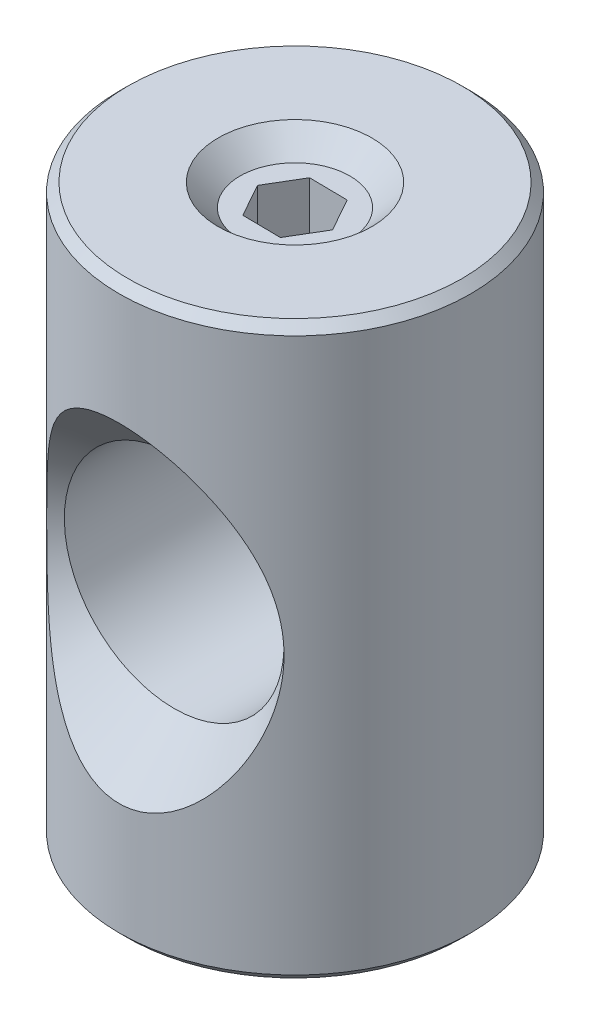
ISO-10303-21;
HEADER;
FILE_DESCRIPTION(('STEP AP214'),'2;1');
FILE_NAME('part.step','',(''),(''),'','','');
FILE_SCHEMA(('AUTOMOTIVE_DESIGN { 1 0 10303 214 1 1 1 1 }'));
ENDSEC;
DATA;
#1=APPLICATION_CONTEXT('core data for automotive mechanical design processes');
#2=APPLICATION_PROTOCOL_DEFINITION('international standard','automotive_design',2000,#1);
#3=PRODUCT_CONTEXT('',#1,'mechanical');
#4=PRODUCT('Part','Part','',(#3));
#5=PRODUCT_RELATED_PRODUCT_CATEGORY('part','',(#4));
#6=PRODUCT_DEFINITION_FORMATION('','',#4);
#7=PRODUCT_DEFINITION_CONTEXT('part definition',#1,'design');
#8=PRODUCT_DEFINITION('design','',#6,#7);
#9=PRODUCT_DEFINITION_SHAPE('','',#8);
#10=(LENGTH_UNIT() NAMED_UNIT(*) SI_UNIT(.MILLI.,.METRE.));
#11=(NAMED_UNIT(*) PLANE_ANGLE_UNIT() SI_UNIT($,.RADIAN.));
#12=(NAMED_UNIT(*) SI_UNIT($,.STERADIAN.) SOLID_ANGLE_UNIT());
#13=UNCERTAINTY_MEASURE_WITH_UNIT(LENGTH_MEASURE(1.E-05),#10,'distance_accuracy_value','');
#14=(GEOMETRIC_REPRESENTATION_CONTEXT(3) GLOBAL_UNCERTAINTY_ASSIGNED_CONTEXT((#13)) GLOBAL_UNIT_ASSIGNED_CONTEXT((#10,
#11,#12)) REPRESENTATION_CONTEXT('',''));
#15=CARTESIAN_POINT('',(0.,0.,0.));
#16=DIRECTION('',(0.,0.,1.));
#17=DIRECTION('',(1.,0.,0.));
#18=AXIS2_PLACEMENT_3D('',#15,#16,#17);
#19=CARTESIAN_POINT('',(0.,-6.5,0.));
#20=DIRECTION('',(0.,1.,0.));
#21=DIRECTION('',(1.,0.,0.));
#22=AXIS2_PLACEMENT_3D('',#19,#20,#21);
#23=CYLINDRICAL_SURFACE('',#22,4.);
#24=CARTESIAN_POINT('',(2.00861961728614,2.50276621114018,3.45911102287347));
#25=CARTESIAN_POINT('',(2.07068051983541,2.40674947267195,3.42307374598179));
#26=CARTESIAN_POINT('',(2.12828569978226,2.30772598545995,3.38739709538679));
#27=CARTESIAN_POINT('',(2.23499920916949,2.10454527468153,3.31795485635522));
#28=CARTESIAN_POINT('',(2.28410222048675,2.00038488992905,3.28419047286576));
#29=CARTESIAN_POINT('',(2.41925308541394,1.68075200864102,3.18740900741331));
#30=CARTESIAN_POINT('',(2.4929833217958,1.45838045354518,3.12900325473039));
#31=CARTESIAN_POINT('',(2.57939038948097,1.11455603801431,3.05747047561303));
#32=CARTESIAN_POINT('',(2.60422468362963,0.997617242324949,3.03623948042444));
#33=CARTESIAN_POINT('',(2.64553280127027,0.761227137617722,3.00031966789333));
#34=CARTESIAN_POINT('',(2.66200666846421,0.641775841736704,2.98563081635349));
#35=CARTESIAN_POINT('',(2.68645392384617,0.401610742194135,2.96365227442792));
#36=CARTESIAN_POINT('',(2.6944465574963,0.280900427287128,2.95634583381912));
#37=CARTESIAN_POINT('',(2.70193242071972,0.0389985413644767,2.94950668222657));
#38=CARTESIAN_POINT('',(2.70142647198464,-0.082192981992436,2.94997321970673));
#39=CARTESIAN_POINT('',(2.69232263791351,-0.313773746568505,2.95828132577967));
#40=CARTESIAN_POINT('',(2.68440932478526,-0.424213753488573,2.96549893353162));
#41=CARTESIAN_POINT('',(2.661516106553,-0.643775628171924,2.98606231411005));
#42=CARTESIAN_POINT('',(2.64653635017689,-0.752897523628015,2.99940795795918));
#43=CARTESIAN_POINT('',(2.60955705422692,-0.969287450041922,3.03163524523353));
#44=CARTESIAN_POINT('',(2.58754645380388,-1.07655227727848,3.05052560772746));
#45=CARTESIAN_POINT('',(2.53656335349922,-1.28848970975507,3.09304816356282));
#46=CARTESIAN_POINT('',(2.50758807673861,-1.39316126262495,3.11668224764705));
#47=CARTESIAN_POINT('',(2.4419039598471,-1.60182800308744,3.16842153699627));
#48=CARTESIAN_POINT('',(2.40502697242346,-1.70574735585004,3.19662003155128));
#49=CARTESIAN_POINT('',(2.32391001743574,-1.90972274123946,3.25606583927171));
#50=CARTESIAN_POINT('',(2.27966979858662,-2.00977864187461,3.28731325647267));
#51=CARTESIAN_POINT('',(2.13567917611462,-2.30324432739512,3.38412458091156));
#52=CARTESIAN_POINT('',(2.02454346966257,-2.49032609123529,3.4528562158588));
#53=CARTESIAN_POINT('',(1.80670773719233,-2.78938690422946,3.57019918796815));
#54=CARTESIAN_POINT('',(1.7081708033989,-2.90735451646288,3.6188311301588));
#55=CARTESIAN_POINT('',(1.49331373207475,-3.12750429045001,3.71264190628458));
#56=CARTESIAN_POINT('',(1.37702449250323,-3.22971327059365,3.75782653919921));
#57=CARTESIAN_POINT('',(1.1574791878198,-3.38973558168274,3.83014990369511));
#58=CARTESIAN_POINT('',(1.05823405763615,-3.45225959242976,3.85897595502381));
#59=CARTESIAN_POINT('',(0.84997902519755,-3.56189454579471,3.91011169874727));
#60=CARTESIAN_POINT('',(0.740982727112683,-3.60902654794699,3.93243029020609));
#61=CARTESIAN_POINT('',(0.532905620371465,-3.67843745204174,3.96551430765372));
#62=CARTESIAN_POINT('',(0.434946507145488,-3.70345312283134,3.97754190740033));
#63=CARTESIAN_POINT('',(0.235740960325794,-3.73822142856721,3.99429466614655));
#64=CARTESIAN_POINT('',(0.134496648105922,-3.7479837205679,3.9990244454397));
#65=CARTESIAN_POINT('',(-0.0684963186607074,-3.75145360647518,4.00070329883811));
#66=CARTESIAN_POINT('',(-0.170245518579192,-3.74513569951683,3.9976400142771));
#67=CARTESIAN_POINT('',(-0.371041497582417,-3.71692499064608,3.98402700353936));
#68=CARTESIAN_POINT('',(-0.470087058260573,-3.69502528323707,3.97347395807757));
#69=CARTESIAN_POINT('',(-0.66191179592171,-3.63761767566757,3.94603230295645));
#70=CARTESIAN_POINT('',(-0.754748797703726,-3.60226516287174,3.9292160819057));
#71=CARTESIAN_POINT('',(-0.933959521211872,-3.52000925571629,3.89051947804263));
#72=CARTESIAN_POINT('',(-1.02033059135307,-3.47310115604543,3.86863703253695));
#73=CARTESIAN_POINT('',(-1.23390786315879,-3.33984983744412,3.80735752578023));
#74=CARTESIAN_POINT('',(-1.35587017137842,-3.24638221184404,3.76514645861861));
#75=CARTESIAN_POINT('',(-1.58220674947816,-3.04205647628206,3.67580135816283));
#76=CARTESIAN_POINT('',(-1.68652864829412,-2.93114840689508,3.62865331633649));
#77=CARTESIAN_POINT('',(-1.91914629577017,-2.64670689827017,3.5128565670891));
#78=CARTESIAN_POINT('',(-2.038983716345,-2.46649516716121,3.44353010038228));
#79=CARTESIAN_POINT('',(-2.1957154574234,-2.18232709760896,3.34404602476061));
#80=CARTESIAN_POINT('',(-2.24415820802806,-2.08519374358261,3.31160595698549));
#81=CARTESIAN_POINT('',(-2.33363503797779,-1.88681329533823,3.24917212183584));
#82=CARTESIAN_POINT('',(-2.37466920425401,-1.78556624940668,3.21917832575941));
#83=CARTESIAN_POINT('',(-2.48866500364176,-1.47149281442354,3.13302341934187));
#84=CARTESIAN_POINT('',(-2.55012907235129,-1.25272590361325,3.08230633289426));
#85=CARTESIAN_POINT('',(-2.61943786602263,-0.917366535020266,3.023148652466));
#86=CARTESIAN_POINT('',(-2.63872260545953,-0.804432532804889,3.00625299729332));
#87=CARTESIAN_POINT('',(-2.66963559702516,-0.576716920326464,2.97883958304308));
#88=CARTESIAN_POINT('',(-2.68126432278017,-0.461935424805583,2.96832142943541));
#89=CARTESIAN_POINT('',(-2.69681445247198,-0.230896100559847,2.9542007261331));
#90=CARTESIAN_POINT('',(-2.70070000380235,-0.114633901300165,2.95063034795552));
#91=CARTESIAN_POINT('',(-2.70062676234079,0.117888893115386,2.95069739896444));
#92=CARTESIAN_POINT('',(-2.69666782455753,0.234149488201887,2.95433496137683));
#93=CARTESIAN_POINT('',(-2.68093012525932,0.465794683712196,2.96862378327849));
#94=CARTESIAN_POINT('',(-2.6691453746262,0.581178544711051,2.97928041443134));
#95=CARTESIAN_POINT('',(-2.63783603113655,0.810073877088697,3.00703300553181));
#96=CARTESIAN_POINT('',(-2.61831140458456,0.923585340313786,3.02412899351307));
#97=CARTESIAN_POINT('',(-2.55110587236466,1.24648906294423,3.08143447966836));
#98=CARTESIAN_POINT('',(-2.49374690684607,1.45269705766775,3.12876771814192));
#99=CARTESIAN_POINT('',(-2.35205369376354,1.85200279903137,3.23662437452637));
#100=CARTESIAN_POINT('',(-2.26770237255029,2.04509215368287,3.29715613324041));
#101=CARTESIAN_POINT('',(-2.08096559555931,2.39494121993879,3.41769527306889));
#102=CARTESIAN_POINT('',(-1.9813663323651,2.55339094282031,3.47710305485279));
#103=CARTESIAN_POINT('',(-1.75753436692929,2.8520431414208,3.59542277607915));
#104=CARTESIAN_POINT('',(-1.63335299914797,2.99228265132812,3.65433548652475));
#105=CARTESIAN_POINT('',(-1.40351711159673,3.20524695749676,3.74700298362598));
#106=CARTESIAN_POINT('',(-1.30517830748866,3.28501634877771,3.78266450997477));
#107=CARTESIAN_POINT('',(-1.09627602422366,3.42951850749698,3.84839159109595));
#108=CARTESIAN_POINT('',(-0.985730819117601,3.49427331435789,3.87846533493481));
#109=CARTESIAN_POINT('',(-0.775074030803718,3.59419077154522,3.92538354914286));
#110=CARTESIAN_POINT('',(-0.676840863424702,3.63261634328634,3.94364787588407));
#111=CARTESIAN_POINT('',(-0.474643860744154,3.69414757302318,3.97304859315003));
#112=CARTESIAN_POINT('',(-0.370684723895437,3.71726559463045,3.98419073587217));
#113=CARTESIAN_POINT('',(-0.159238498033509,3.7463751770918,3.99823881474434));
#114=CARTESIAN_POINT('',(-0.0517358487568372,3.75227687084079,4.00110153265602));
#115=CARTESIAN_POINT('',(0.162625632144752,3.74613465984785,3.99812989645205));
#116=CARTESIAN_POINT('',(0.269484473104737,3.73409101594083,3.99229566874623));
#117=CARTESIAN_POINT('',(0.470766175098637,3.69480578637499,3.97338656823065));
#118=CARTESIAN_POINT('',(0.565504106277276,3.66884179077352,3.96092097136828));
#119=CARTESIAN_POINT('',(0.749607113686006,3.60438308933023,3.93024386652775));
#120=CARTESIAN_POINT('',(0.838968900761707,3.56588080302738,3.91202888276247));
#121=CARTESIAN_POINT('',(1.05029191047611,3.45843472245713,3.8617928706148));
#122=CARTESIAN_POINT('',(1.16865670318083,3.38360434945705,3.82725704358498));
#123=CARTESIAN_POINT('',(1.39070907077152,3.21713345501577,3.75229749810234));
#124=CARTESIAN_POINT('',(1.49437212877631,3.12546542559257,3.71186416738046));
#125=CARTESIAN_POINT('',(1.66972020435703,2.94744858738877,3.63584960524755));
#126=CARTESIAN_POINT('',(1.74378447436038,2.86320169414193,3.60073643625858));
#127=CARTESIAN_POINT('',(1.88285902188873,2.68784988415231,3.5300038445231));
#128=CARTESIAN_POINT('',(1.94787376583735,2.59674838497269,3.49438468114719));
#129=CARTESIAN_POINT('',(2.00861961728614,2.50276621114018,3.45911102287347));
#130=B_SPLINE_CURVE_WITH_KNOTS('',3,(#24,#25,#26,#27,#28,#29,#30,#31,#32,#33,#34,#35,#36,#37,
#38,#39,#40,#41,#42,#43,#44,#45,#46,#47,#48,#49,#50,#51,#52,#53,#54,#55,#56,#57,#58,#59,#60,#61,
#62,#63,#64,#65,#66,#67,#68,#69,#70,#71,#72,#73,#74,#75,#76,#77,#78,#79,#80,#81,#82,#83,#84,#85,
#86,#87,#88,#89,#90,#91,#92,#93,#94,#95,#96,#97,#98,#99,#100,#101,#102,#103,#104,#105,#106,#107,
#108,#109,#110,#111,#112,#113,#114,#115,#116,#117,#118,#119,#120,#121,#122,#123,#124,#125,#126,
#127,#128,#129),.UNSPECIFIED.,.T.,.F.,(4,2,2,2,2,2,2,2,2,2,2,2,2,2,2,2,2,2,2,2,2,2,2,2,2,2,2,2,
2,2,2,2,2,2,2,2,2,2,2,2,2,2,2,2,2,2,2,2,2,2,2,2,4),(0.,0.359483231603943,0.719190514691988,
1.43953936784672,1.8034229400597,2.16730461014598,2.53035878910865,2.89337786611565,
3.22584653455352,3.55830820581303,3.89129549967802,4.22441577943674,4.56549060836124,
4.90657707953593,5.58755117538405,6.06987874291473,6.55137619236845,6.91248699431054,
7.27310162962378,7.57722192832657,7.88114960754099,8.18555957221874,8.49010452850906,
8.79123364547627,9.09248558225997,9.56781726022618,10.0445362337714,10.7224100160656,
11.0620148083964,11.4016156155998,12.0964234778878,12.4435061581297,12.7905673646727,
13.1392318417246,13.4879027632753,13.8368408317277,14.1857804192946,14.840627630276,
15.495889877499,16.0830361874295,16.6689690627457,17.0624128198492,17.455275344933,
17.7751340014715,18.0947339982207,18.415999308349,18.7372599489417,19.033107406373,
19.329134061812,19.7594205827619,20.1904164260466,20.5424566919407,20.8943225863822),.UNSPECIFIED.);
#131=CARTESIAN_POINT('',(2.00861961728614,2.50276621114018,3.45911102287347));
#132=VERTEX_POINT('',#131);
#133=EDGE_CURVE('E105',#132,#132,#130,.T.);
#134=ORIENTED_EDGE('',*,*,#133,.T.);
#135=EDGE_LOOP('',(#134));
#136=FACE_BOUND('',#135,.T.);
#137=CARTESIAN_POINT('',(1.94823116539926,2.4029163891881,-3.49347917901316));
#138=CARTESIAN_POINT('',(1.8682534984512,2.52518801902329,-3.53808317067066));
#139=CARTESIAN_POINT('',(1.78071300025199,2.64235140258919,-3.58332071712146));
#140=CARTESIAN_POINT('',(1.58944179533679,2.86358520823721,-3.67216387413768));
#141=CARTESIAN_POINT('',(1.48571136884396,2.96765585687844,-3.71576951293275));
#142=CARTESIAN_POINT('',(1.28321750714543,3.1395912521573,-3.78980046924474));
#143=CARTESIAN_POINT('',(1.18744263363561,3.21055727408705,-3.82113646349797));
#144=CARTESIAN_POINT('',(0.985067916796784,3.33783294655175,-3.87822701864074));
#145=CARTESIAN_POINT('',(0.878483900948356,3.39416360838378,-3.90398957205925));
#146=CARTESIAN_POINT('',(0.6740967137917,3.48064858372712,-3.94392992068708));
#147=CARTESIAN_POINT('',(0.577716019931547,3.51357952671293,-3.95931420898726));
#148=CARTESIAN_POINT('',(0.380212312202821,3.56433264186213,-3.98312706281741));
#149=CARTESIAN_POINT('',(0.279092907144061,3.58216612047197,-3.99156083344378));
#150=CARTESIAN_POINT('',(0.0745344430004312,3.60131541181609,-4.00061958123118));
#151=CARTESIAN_POINT('',(-0.0289119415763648,3.60256851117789,-4.00121491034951));
#152=CARTESIAN_POINT('',(-0.234371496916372,3.58827965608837,-3.99445153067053));
#153=CARTESIAN_POINT('',(-0.336384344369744,3.57273397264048,-3.98709105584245));
#154=CARTESIAN_POINT('',(-0.530407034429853,3.52746005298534,-3.96581412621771));
#155=CARTESIAN_POINT('',(-0.622658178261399,3.4985624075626,-3.95228214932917));
#156=CARTESIAN_POINT('',(-0.801472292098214,3.42878573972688,-3.91993814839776));
#157=CARTESIAN_POINT('',(-0.888033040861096,3.38790207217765,-3.90112407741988));
#158=CARTESIAN_POINT('',(-1.09555298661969,3.27349048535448,-3.8491770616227));
#159=CARTESIAN_POINT('',(-1.21249185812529,3.19379673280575,-3.81355270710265));
#160=CARTESIAN_POINT('',(-1.43106281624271,3.01766621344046,-3.73705117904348));
#161=CARTESIAN_POINT('',(-1.53265363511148,2.92118575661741,-3.6961603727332));
#162=CARTESIAN_POINT('',(-1.76086998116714,2.67214196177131,-3.59456008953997));
#163=CARTESIAN_POINT('',(-1.87996613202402,2.51309424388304,-3.53276969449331));
#164=CARTESIAN_POINT('',(-2.03789471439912,2.26110171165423,-3.44247720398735));
#165=CARTESIAN_POINT('',(-2.08712518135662,2.17477098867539,-3.41274901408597));
#166=CARTESIAN_POINT('',(-2.17894242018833,1.99813495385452,-3.35487000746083));
#167=CARTESIAN_POINT('',(-2.22152934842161,1.90782973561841,-3.32671915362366));
#168=CARTESIAN_POINT('',(-2.34184927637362,1.62635635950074,-3.24429047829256));
#169=CARTESIAN_POINT('',(-2.40918606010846,1.42941274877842,-3.19382692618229));
#170=CARTESIAN_POINT('',(-2.4898183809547,1.12632219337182,-3.13080526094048));
#171=CARTESIAN_POINT('',(-2.51329911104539,1.02402267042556,-3.111911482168));
#172=CARTESIAN_POINT('',(-2.55345072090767,0.817321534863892,-3.07905339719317));
#173=CARTESIAN_POINT('',(-2.57012429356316,0.71292077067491,-3.06508714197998));
#174=CARTESIAN_POINT('',(-2.59753916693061,0.495132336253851,-3.04189707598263));
#175=CARTESIAN_POINT('',(-2.60777058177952,0.381636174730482,-3.03308414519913));
#176=CARTESIAN_POINT('',(-2.6202602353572,0.153873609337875,-3.02230137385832));
#177=CARTESIAN_POINT('',(-2.62251822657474,0.0396071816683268,-3.02033174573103));
#178=CARTESIAN_POINT('',(-2.61904102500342,-0.188693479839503,-3.02334731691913));
#179=CARTESIAN_POINT('',(-2.61330701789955,-0.302727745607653,-3.02833148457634));
#180=CARTESIAN_POINT('',(-2.59389533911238,-0.529617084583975,-3.04497433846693));
#181=CARTESIAN_POINT('',(-2.58021784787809,-0.642472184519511,-3.05663287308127));
#182=CARTESIAN_POINT('',(-2.54643433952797,-0.857073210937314,-3.08481982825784));
#183=CARTESIAN_POINT('',(-2.52693927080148,-0.95897812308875,-3.10087690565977));
#184=CARTESIAN_POINT('',(-2.48137742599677,-1.16050280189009,-3.13745330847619));
#185=CARTESIAN_POINT('',(-2.45530786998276,-1.26012158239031,-3.15797452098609));
#186=CARTESIAN_POINT('',(-2.36716520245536,-1.55517140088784,-3.22521989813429));
#187=CARTESIAN_POINT('',(-2.29519953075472,-1.74653074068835,-3.27758771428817));
#188=CARTESIAN_POINT('',(-2.16306481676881,-2.03093348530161,-3.36515673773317));
#189=CARTESIAN_POINT('',(-2.11223406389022,-2.12936575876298,-3.39743671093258));
#190=CARTESIAN_POINT('',(-2.00221381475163,-2.32094555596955,-3.46341736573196));
#191=CARTESIAN_POINT('',(-1.94302145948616,-2.41409125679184,-3.49711853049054));
#192=CARTESIAN_POINT('',(-1.75265448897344,-2.68365657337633,-3.59845339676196));
#193=CARTESIAN_POINT('',(-1.60824436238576,-2.85119730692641,-3.66664073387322));
#194=CARTESIAN_POINT('',(-1.35615272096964,-3.0809999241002,-3.76429239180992));
#195=CARTESIAN_POINT('',(-1.26170986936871,-3.15645178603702,-3.79724596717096));
#196=CARTESIAN_POINT('',(-1.06149013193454,-3.29312923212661,-3.85799680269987));
#197=CARTESIAN_POINT('',(-0.955730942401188,-3.35437656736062,-3.88580193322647));
#198=CARTESIAN_POINT('',(-0.751797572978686,-3.45035216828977,-3.9298670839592));
#199=CARTESIAN_POINT('',(-0.655143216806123,-3.48776231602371,-3.94726509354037));
#200=CARTESIAN_POINT('',(-0.456275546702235,-3.54740816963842,-3.97515551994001));
#201=CARTESIAN_POINT('',(-0.354066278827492,-3.56965476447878,-3.98565289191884));
#202=CARTESIAN_POINT('',(-0.146320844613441,-3.59723361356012,-3.9986825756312));
#203=CARTESIAN_POINT('',(-0.0407706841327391,-3.60248137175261,-4.00117509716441));
#204=CARTESIAN_POINT('',(0.169588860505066,-3.59532880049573,-3.99778770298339));
#205=CARTESIAN_POINT('',(0.274398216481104,-3.58292780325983,-3.99190747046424));
#206=CARTESIAN_POINT('',(0.471881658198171,-3.54322573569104,-3.9732118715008));
#207=CARTESIAN_POINT('',(0.564865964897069,-3.51715696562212,-3.96097072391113));
#208=CARTESIAN_POINT('',(0.745472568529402,-3.45269897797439,-3.93098802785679));
#209=CARTESIAN_POINT('',(0.833092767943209,-3.41430497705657,-3.91324434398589));
#210=CARTESIAN_POINT('',(1.04012384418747,-3.30738388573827,-3.86445435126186));
#211=CARTESIAN_POINT('',(1.1559887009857,-3.23308206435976,-3.83102118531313));
#212=CARTESIAN_POINT('',(1.37328558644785,-3.06787861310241,-3.75862781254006));
#213=CARTESIAN_POINT('',(1.47468059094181,-2.97693571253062,-3.71965391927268));
#214=CARTESIAN_POINT('',(1.70359151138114,-2.74105580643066,-3.62204261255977));
#215=CARTESIAN_POINT('',(1.82383610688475,-2.58962051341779,-3.5621009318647));
#216=CARTESIAN_POINT('',(2.03798945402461,-2.26864543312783,-3.44406087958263));
#217=CARTESIAN_POINT('',(2.13186023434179,-2.09908002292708,-3.38596527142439));
#218=CARTESIAN_POINT('',(2.29757357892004,-1.7403633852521,-3.27587574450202));
#219=CARTESIAN_POINT('',(2.36861103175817,-1.55075777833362,-3.22413800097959));
#220=CARTESIAN_POINT('',(2.45578122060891,-1.25831996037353,-3.15760274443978));
#221=CARTESIAN_POINT('',(2.48160598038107,-1.15950864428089,-3.13727044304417));
#222=CARTESIAN_POINT('',(2.52678635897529,-0.959637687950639,-3.10099904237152));
#223=CARTESIAN_POINT('',(2.54614430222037,-0.858578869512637,-3.08505836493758));
#224=CARTESIAN_POINT('',(2.58006811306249,-0.643788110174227,-3.05676156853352));
#225=CARTESIAN_POINT('',(2.59389412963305,-0.529862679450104,-3.04497578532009));
#226=CARTESIAN_POINT('',(2.61345100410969,-0.300811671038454,-3.02820761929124));
#227=CARTESIAN_POINT('',(2.61918156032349,-0.185686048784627,-3.02322549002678));
#228=CARTESIAN_POINT('',(2.62249932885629,0.0448130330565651,-3.02034807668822));
#229=CARTESIAN_POINT('',(2.62008368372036,0.160186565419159,-3.0224552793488));
#230=CARTESIAN_POINT('',(2.60712400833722,0.390127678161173,-3.03364080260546));
#231=CARTESIAN_POINT('',(2.59658023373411,0.50469528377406,-3.04271890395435));
#232=CARTESIAN_POINT('',(2.56872276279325,0.722098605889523,-3.06626205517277));
#233=CARTESIAN_POINT('',(2.55208513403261,0.825080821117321,-3.08018383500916));
#234=CARTESIAN_POINT('',(2.51218481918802,1.02898226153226,-3.11280977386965));
#235=CARTESIAN_POINT('',(2.48892002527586,1.12990081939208,-3.13151545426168));
#236=CARTESIAN_POINT('',(2.4093079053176,1.42854484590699,-3.19371508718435));
#237=CARTESIAN_POINT('',(2.34309532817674,1.62253079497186,-3.24333627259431));
#238=CARTESIAN_POINT('',(2.21947686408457,1.91311369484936,-3.32817815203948));
#239=CARTESIAN_POINT('',(2.17118876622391,2.01474705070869,-3.36002532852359));
#240=CARTESIAN_POINT('',(2.06614997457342,2.21288714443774,-3.42561836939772));
#241=CARTESIAN_POINT('',(2.00940272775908,2.3093959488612,-3.45936345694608));
#242=CARTESIAN_POINT('',(1.94823116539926,2.4029163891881,-3.49347917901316));
#243=B_SPLINE_CURVE_WITH_KNOTS('',3,(#137,#138,#139,#140,#141,#142,#143,#144,#145,#146,#147,
#148,#149,#150,#151,#152,#153,#154,#155,#156,#157,#158,#159,#160,#161,#162,#163,#164,#165,#166,
#167,#168,#169,#170,#171,#172,#173,#174,#175,#176,#177,#178,#179,#180,#181,#182,#183,#184,#185,
#186,#187,#188,#189,#190,#191,#192,#193,#194,#195,#196,#197,#198,#199,#200,#201,#202,#203,#204,
#205,#206,#207,#208,#209,#210,#211,#212,#213,#214,#215,#216,#217,#218,#219,#220,#221,#222,#223,
#224,#225,#226,#227,#228,#229,#230,#231,#232,#233,#234,#235,#236,#237,#238,#239,#240,#241,#242),
.UNSPECIFIED.,.T.,.F.,(4,2,2,2,2,2,2,2,2,2,2,2,2,2,2,2,2,2,2,2,2,2,2,2,2,2,2,2,2,2,2,2,2,2,2,2,
2,2,2,2,2,2,2,2,2,2,2,2,2,2,2,2,4),(0.,0.458054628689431,0.916101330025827,1.28466420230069,
1.65269498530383,1.96042706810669,2.26792848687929,2.57659266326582,2.88532537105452,
3.17700932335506,3.46880646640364,3.90411676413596,4.34057745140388,4.96124125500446,
5.27221794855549,5.58318732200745,6.2226552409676,6.54232985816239,6.8618778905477,
7.20429239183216,7.54671752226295,7.8890918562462,8.23145841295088,8.5460734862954,
8.86082181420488,9.49112347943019,9.83691382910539,10.182822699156,10.8712769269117,
11.2460945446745,11.6203343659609,11.9343268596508,12.2480936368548,12.5634176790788,
12.8787536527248,13.1695937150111,13.4605467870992,13.8830980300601,14.3067117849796,
14.9107714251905,15.5156963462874,16.1400669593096,16.4522146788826,16.7642500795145,
17.1098640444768,17.4554908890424,17.8012389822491,18.1469762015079,18.4623421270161,
18.777808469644,19.4076196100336,19.7581088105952,20.1084555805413),.UNSPECIFIED.);
#244=CARTESIAN_POINT('',(1.94823116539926,2.4029163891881,-3.49347917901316));
#245=VERTEX_POINT('',#244);
#246=EDGE_CURVE('E139',#245,#245,#243,.T.);
#247=ORIENTED_EDGE('',*,*,#246,.T.);
#248=EDGE_LOOP('',(#247));
#249=FACE_BOUND('',#248,.T.);
#250=CARTESIAN_POINT('',(0.,6.3,0.));
#251=DIRECTION('',(0.,-1.,0.));
#252=DIRECTION('',(-1.,0.,0.));
#253=AXIS2_PLACEMENT_3D('',#250,#251,#252);
#254=CIRCLE('',#253,4.);
#255=CARTESIAN_POINT('',(-4.,6.3,0.));
#256=VERTEX_POINT('',#255);
#257=EDGE_CURVE('E130',#256,#256,#254,.T.);
#258=ORIENTED_EDGE('',*,*,#257,.T.);
#259=EDGE_LOOP('',(#258));
#260=FACE_BOUND('',#259,.T.);
#261=CARTESIAN_POINT('',(0.,-6.3,0.));
#262=DIRECTION('',(0.,-1.,0.));
#263=DIRECTION('',(-1.,0.,0.));
#264=AXIS2_PLACEMENT_3D('',#261,#262,#263);
#265=CIRCLE('',#264,4.);
#266=CARTESIAN_POINT('',(-4.,-6.3,0.));
#267=VERTEX_POINT('',#266);
#268=EDGE_CURVE('E126',#267,#267,#265,.F.);
#269=ORIENTED_EDGE('',*,*,#268,.T.);
#270=EDGE_LOOP('',(#269));
#271=FACE_BOUND('',#270,.T.);
#272=ADVANCED_FACE('F14',(#136,#249,#260,#271),#23,.T.);
#273=CARTESIAN_POINT('',(0.,-6.5,0.));
#274=DIRECTION('',(0.,-1.,0.));
#275=DIRECTION('',(-1.,0.,0.));
#276=AXIS2_PLACEMENT_3D('',#273,#274,#275);
#277=PLANE('',#276);
#278=CARTESIAN_POINT('',(0.,-6.5,0.));
#279=DIRECTION('',(0.,-1.,0.));
#280=DIRECTION('',(-1.,0.,0.));
#281=AXIS2_PLACEMENT_3D('',#278,#279,#280);
#282=CIRCLE('',#281,3.8);
#283=CARTESIAN_POINT('',(-3.8,-6.5,0.));
#284=VERTEX_POINT('',#283);
#285=EDGE_CURVE('E136',#284,#284,#282,.T.);
#286=ORIENTED_EDGE('',*,*,#285,.T.);
#287=EDGE_LOOP('',(#286));
#288=FACE_BOUND('',#287,.T.);
#289=ADVANCED_FACE('F161',(#288),#277,.T.);
#290=CARTESIAN_POINT('',(0.,6.5,0.));
#291=DIRECTION('',(0.,-1.,0.));
#292=DIRECTION('',(-1.,0.,0.));
#293=AXIS2_PLACEMENT_3D('',#290,#291,#292);
#294=PLANE('',#293);
#295=CARTESIAN_POINT('',(0.,6.5,0.));
#296=DIRECTION('',(0.,1.,0.));
#297=DIRECTION('',(1.,0.,0.));
#298=AXIS2_PLACEMENT_3D('',#295,#296,#297);
#299=CIRCLE('',#298,1.75);
#300=CARTESIAN_POINT('',(1.75,6.5,0.));
#301=VERTEX_POINT('',#300);
#302=EDGE_CURVE('E123',#301,#301,#299,.T.);
#303=ORIENTED_EDGE('',*,*,#302,.F.);
#304=EDGE_LOOP('',(#303));
#305=FACE_BOUND('',#304,.T.);
#306=CARTESIAN_POINT('',(0.,6.5,0.));
#307=DIRECTION('',(0.,-1.,0.));
#308=DIRECTION('',(-1.,0.,0.));
#309=AXIS2_PLACEMENT_3D('',#306,#307,#308);
#310=CIRCLE('',#309,3.8);
#311=CARTESIAN_POINT('',(-3.8,6.5,0.));
#312=VERTEX_POINT('',#311);
#313=EDGE_CURVE('E133',#312,#312,#310,.F.);
#314=ORIENTED_EDGE('',*,*,#313,.T.);
#315=EDGE_LOOP('',(#314));
#316=FACE_BOUND('',#315,.T.);
#317=ADVANCED_FACE('F163',(#305,#316),#294,.F.);
#318=CARTESIAN_POINT('',(0.,6.3,0.));
#319=DIRECTION('',(0.,-1.,0.));
#320=DIRECTION('',(-1.,0.,0.));
#321=AXIS2_PLACEMENT_3D('',#318,#319,#320);
#322=CONICAL_SURFACE('',#321,4.,0.785398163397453);
#323=ORIENTED_EDGE('',*,*,#313,.F.);
#324=EDGE_LOOP('',(#323));
#325=FACE_BOUND('',#324,.T.);
#326=ORIENTED_EDGE('',*,*,#257,.F.);
#327=EDGE_LOOP('',(#326));
#328=FACE_BOUND('',#327,.T.);
#329=ADVANCED_FACE('F166',(#325,#328),#322,.T.);
#330=CARTESIAN_POINT('',(0.,-6.5,0.));
#331=DIRECTION('',(0.,1.,0.));
#332=DIRECTION('',(1.,0.,0.));
#333=AXIS2_PLACEMENT_3D('',#330,#331,#332);
#334=CONICAL_SURFACE('',#333,3.8,0.785398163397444);
#335=ORIENTED_EDGE('',*,*,#268,.F.);
#336=EDGE_LOOP('',(#335));
#337=FACE_BOUND('',#336,.T.);
#338=ORIENTED_EDGE('',*,*,#285,.F.);
#339=EDGE_LOOP('',(#338));
#340=FACE_BOUND('',#339,.T.);
#341=ADVANCED_FACE('F16',(#337,#340),#334,.T.);
#342=CARTESIAN_POINT('',(0.,0.,2.35));
#343=DIRECTION('',(0.,0.,1.));
#344=DIRECTION('',(0.,1.,0.));
#345=AXIS2_PLACEMENT_3D('',#342,#343,#344);
#346=CONICAL_SURFACE('',#345,2.1,0.785398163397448);
#347=CARTESIAN_POINT('',(0.,0.,2.75));
#348=DIRECTION('',(0.,0.,1.));
#349=DIRECTION('',(0.,-1.,0.));
#350=AXIS2_PLACEMENT_3D('',#347,#348,#349);
#351=CIRCLE('',#350,2.5);
#352=CARTESIAN_POINT('',(0.,-2.5,2.75));
#353=VERTEX_POINT('',#352);
#354=EDGE_CURVE('E127',#353,#353,#351,.F.);
#355=ORIENTED_EDGE('',*,*,#354,.T.);
#356=EDGE_LOOP('',(#355));
#357=FACE_BOUND('',#356,.T.);
#358=ORIENTED_EDGE('',*,*,#133,.F.);
#359=EDGE_LOOP('',(#358));
#360=FACE_BOUND('',#359,.T.);
#361=ADVANCED_FACE('F157',(#357,#360),#346,.F.);
#362=CARTESIAN_POINT('',(0.,0.,-4.));
#363=DIRECTION('',(0.,0.,-1.));
#364=DIRECTION('',(0.,-1.,0.));
#365=AXIS2_PLACEMENT_3D('',#362,#363,#364);
#366=CONICAL_SURFACE('',#365,3.6,0.785398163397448);
#367=CARTESIAN_POINT('',(0.,0.,-2.9));
#368=DIRECTION('',(0.,0.,-1.));
#369=DIRECTION('',(0.,1.,0.));
#370=AXIS2_PLACEMENT_3D('',#367,#368,#369);
#371=CIRCLE('',#370,2.5);
#372=CARTESIAN_POINT('',(0.,2.5,-2.9));
#373=VERTEX_POINT('',#372);
#374=EDGE_CURVE('E18',#373,#373,#371,.F.);
#375=ORIENTED_EDGE('',*,*,#374,.T.);
#376=EDGE_LOOP('',(#375));
#377=FACE_BOUND('',#376,.T.);
#378=ORIENTED_EDGE('',*,*,#246,.F.);
#379=EDGE_LOOP('',(#378));
#380=FACE_BOUND('',#379,.T.);
#381=ADVANCED_FACE('F152',(#377,#380),#366,.F.);
#382=CARTESIAN_POINT('',(0.,6.5,0.));
#383=DIRECTION('',(0.,1.,0.));
#384=DIRECTION('',(1.,0.,0.));
#385=AXIS2_PLACEMENT_3D('',#382,#383,#384);
#386=CONICAL_SURFACE('',#385,1.75,0.785398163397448);
#387=CARTESIAN_POINT('',(0.,6.,0.));
#388=DIRECTION('',(0.,-1.,0.));
#389=DIRECTION('',(1.,0.,0.));
#390=AXIS2_PLACEMENT_3D('',#387,#388,#389);
#391=CIRCLE('',#390,1.25);
#392=CARTESIAN_POINT('',(1.25,6.,0.));
#393=VERTEX_POINT('',#392);
#394=EDGE_CURVE('E9',#393,#393,#391,.T.);
#395=ORIENTED_EDGE('',*,*,#394,.T.);
#396=EDGE_LOOP('',(#395));
#397=FACE_BOUND('',#396,.T.);
#398=ORIENTED_EDGE('',*,*,#302,.T.);
#399=EDGE_LOOP('',(#398));
#400=FACE_BOUND('',#399,.T.);
#401=ADVANCED_FACE('F156',(#397,#400),#386,.F.);
#402=CARTESIAN_POINT('',(0.,6.,0.));
#403=DIRECTION('',(0.,-1.,0.));
#404=DIRECTION('',(0.999915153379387,0.,0.0130263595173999));
#405=AXIS2_PLACEMENT_3D('',#402,#403,#404);
#406=PLANE('',#405);
#407=DIRECTION('',(0.488676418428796,0.,0.872465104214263));
#408=VECTOR('',#407,1.);
#409=CARTESIAN_POINT('',(-0.865951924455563,6.,-0.0112811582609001));
#410=LINE('',#409,#408);
#411=CARTESIAN_POINT('',(-0.865951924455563,6.,-0.0112811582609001));
#412=VERTEX_POINT('',#411);
#413=CARTESIAN_POINT('',(-0.442745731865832,6.,0.744295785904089));
#414=VERTEX_POINT('',#413);
#415=EDGE_CURVE('E104',#412,#414,#410,.T.);
#416=ORIENTED_EDGE('',*,*,#415,.F.);
#417=DIRECTION('',(-0.511238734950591,0.,0.859438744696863));
#418=VECTOR('',#417,1.);
#419=CARTESIAN_POINT('',(-0.423206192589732,6.,-0.755576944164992));
#420=LINE('',#419,#418);
#421=CARTESIAN_POINT('',(-0.423206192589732,6.,-0.755576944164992));
#422=VERTEX_POINT('',#421);
#423=EDGE_CURVE('E31',#422,#412,#420,.T.);
#424=ORIENTED_EDGE('',*,*,#423,.F.);
#425=DIRECTION('',(-0.999915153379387,0.,-0.0130263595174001));
#426=VECTOR('',#425,1.);
#427=CARTESIAN_POINT('',(0.442745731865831,6.,-0.744295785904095));
#428=LINE('',#427,#426);
#429=CARTESIAN_POINT('',(0.442745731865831,6.,-0.744295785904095));
#430=VERTEX_POINT('',#429);
#431=EDGE_CURVE('E114',#430,#422,#428,.T.);
#432=ORIENTED_EDGE('',*,*,#431,.F.);
#433=DIRECTION('',(-0.488676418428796,0.,-0.872465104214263));
#434=VECTOR('',#433,1.);
#435=CARTESIAN_POINT('',(0.865951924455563,6.,0.0112811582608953));
#436=LINE('',#435,#434);
#437=CARTESIAN_POINT('',(0.865951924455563,6.,0.0112811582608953));
#438=VERTEX_POINT('',#437);
#439=EDGE_CURVE('E112',#438,#430,#436,.T.);
#440=ORIENTED_EDGE('',*,*,#439,.F.);
#441=DIRECTION('',(0.511238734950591,0.,-0.859438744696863));
#442=VECTOR('',#441,1.);
#443=CARTESIAN_POINT('',(0.423206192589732,6.,0.755576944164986));
#444=LINE('',#443,#442);
#445=CARTESIAN_POINT('',(0.423206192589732,6.,0.755576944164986));
#446=VERTEX_POINT('',#445);
#447=EDGE_CURVE('E78',#446,#438,#444,.T.);
#448=ORIENTED_EDGE('',*,*,#447,.F.);
#449=DIRECTION('',(0.999915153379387,0.,0.0130263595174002));
#450=VECTOR('',#449,1.);
#451=CARTESIAN_POINT('',(-0.442745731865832,6.,0.744295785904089));
#452=LINE('',#451,#450);
#453=EDGE_CURVE('E108',#414,#446,#452,.T.);
#454=ORIENTED_EDGE('',*,*,#453,.F.);
#455=EDGE_LOOP('',(#416,#424,#432,#440,#448,#454));
#456=FACE_BOUND('',#455,.T.);
#457=ORIENTED_EDGE('',*,*,#394,.F.);
#458=EDGE_LOOP('',(#457));
#459=FACE_BOUND('',#458,.T.);
#460=ADVANCED_FACE('F215',(#456,#459),#406,.F.);
#461=CARTESIAN_POINT('',(-0.423206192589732,4.8,-0.755576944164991));
#462=DIRECTION('',(-0.859438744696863,0.,-0.511238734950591));
#463=DIRECTION('',(-0.511238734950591,0.,0.859438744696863));
#464=AXIS2_PLACEMENT_3D('',#461,#462,#463);
#465=PLANE('',#464);
#466=ORIENTED_EDGE('',*,*,#423,.T.);
#467=DIRECTION('',(0.,1.,0.));
#468=VECTOR('',#467,1.);
#469=CARTESIAN_POINT('',(-0.865951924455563,4.8,-0.0112811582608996));
#470=LINE('',#469,#468);
#471=CARTESIAN_POINT('',(-0.865951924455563,4.8,-0.0112811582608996));
#472=VERTEX_POINT('',#471);
#473=EDGE_CURVE('E60',#472,#412,#470,.T.);
#474=ORIENTED_EDGE('',*,*,#473,.F.);
#475=DIRECTION('',(-0.511238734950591,0.,0.859438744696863));
#476=VECTOR('',#475,1.);
#477=CARTESIAN_POINT('',(-0.423206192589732,4.8,-0.755576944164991));
#478=LINE('',#477,#476);
#479=CARTESIAN_POINT('',(-0.423206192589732,4.8,-0.755576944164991));
#480=VERTEX_POINT('',#479);
#481=EDGE_CURVE('E116',#480,#472,#478,.T.);
#482=ORIENTED_EDGE('',*,*,#481,.F.);
#483=DIRECTION('',(0.,1.,0.));
#484=VECTOR('',#483,1.);
#485=CARTESIAN_POINT('',(-0.423206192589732,4.8,-0.755576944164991));
#486=LINE('',#485,#484);
#487=EDGE_CURVE('E23',#480,#422,#486,.T.);
#488=ORIENTED_EDGE('',*,*,#487,.T.);
#489=EDGE_LOOP('',(#466,#474,#482,#488));
#490=FACE_BOUND('',#489,.T.);
#491=ADVANCED_FACE('F220',(#490),#465,.F.);
#492=CARTESIAN_POINT('',(0.442745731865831,4.8,-0.744295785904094));
#493=DIRECTION('',(0.0130263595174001,0.,-0.999915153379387));
#494=DIRECTION('',(-0.999915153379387,0.,-0.0130263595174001));
#495=AXIS2_PLACEMENT_3D('',#492,#493,#494);
#496=PLANE('',#495);
#497=ORIENTED_EDGE('',*,*,#431,.T.);
#498=ORIENTED_EDGE('',*,*,#487,.F.);
#499=DIRECTION('',(-0.999915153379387,0.,-0.0130263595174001));
#500=VECTOR('',#499,1.);
#501=CARTESIAN_POINT('',(0.442745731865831,4.8,-0.744295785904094));
#502=LINE('',#501,#500);
#503=CARTESIAN_POINT('',(0.442745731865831,4.8,-0.744295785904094));
#504=VERTEX_POINT('',#503);
#505=EDGE_CURVE('E90',#504,#480,#502,.T.);
#506=ORIENTED_EDGE('',*,*,#505,.F.);
#507=DIRECTION('',(0.,1.,0.));
#508=VECTOR('',#507,1.);
#509=CARTESIAN_POINT('',(0.442745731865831,4.8,-0.744295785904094));
#510=LINE('',#509,#508);
#511=EDGE_CURVE('E82',#504,#430,#510,.T.);
#512=ORIENTED_EDGE('',*,*,#511,.T.);
#513=EDGE_LOOP('',(#497,#498,#506,#512));
#514=FACE_BOUND('',#513,.T.);
#515=ADVANCED_FACE('F218',(#514),#496,.F.);
#516=CARTESIAN_POINT('',(0.865951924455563,4.8,0.0112811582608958));
#517=DIRECTION('',(0.872465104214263,0.,-0.488676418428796));
#518=DIRECTION('',(-0.488676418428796,0.,-0.872465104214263));
#519=AXIS2_PLACEMENT_3D('',#516,#517,#518);
#520=PLANE('',#519);
#521=ORIENTED_EDGE('',*,*,#439,.T.);
#522=ORIENTED_EDGE('',*,*,#511,.F.);
#523=DIRECTION('',(-0.488676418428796,0.,-0.872465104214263));
#524=VECTOR('',#523,1.);
#525=CARTESIAN_POINT('',(0.865951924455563,4.8,0.0112811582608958));
#526=LINE('',#525,#524);
#527=CARTESIAN_POINT('',(0.865951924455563,4.8,0.0112811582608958));
#528=VERTEX_POINT('',#527);
#529=EDGE_CURVE('E86',#528,#504,#526,.T.);
#530=ORIENTED_EDGE('',*,*,#529,.F.);
#531=DIRECTION('',(0.,1.,0.));
#532=VECTOR('',#531,1.);
#533=CARTESIAN_POINT('',(0.865951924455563,4.8,0.0112811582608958));
#534=LINE('',#533,#532);
#535=EDGE_CURVE('E71',#528,#438,#534,.T.);
#536=ORIENTED_EDGE('',*,*,#535,.T.);
#537=EDGE_LOOP('',(#521,#522,#530,#536));
#538=FACE_BOUND('',#537,.T.);
#539=ADVANCED_FACE('F87',(#538),#520,.F.);
#540=CARTESIAN_POINT('',(0.423206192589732,4.8,0.755576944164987));
#541=DIRECTION('',(0.859438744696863,0.,0.511238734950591));
#542=DIRECTION('',(0.511238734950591,0.,-0.859438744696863));
#543=AXIS2_PLACEMENT_3D('',#540,#541,#542);
#544=PLANE('',#543);
#545=ORIENTED_EDGE('',*,*,#447,.T.);
#546=ORIENTED_EDGE('',*,*,#535,.F.);
#547=DIRECTION('',(0.511238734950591,0.,-0.859438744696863));
#548=VECTOR('',#547,1.);
#549=CARTESIAN_POINT('',(0.423206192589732,4.8,0.755576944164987));
#550=LINE('',#549,#548);
#551=CARTESIAN_POINT('',(0.423206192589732,4.8,0.755576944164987));
#552=VERTEX_POINT('',#551);
#553=EDGE_CURVE('E75',#552,#528,#550,.T.);
#554=ORIENTED_EDGE('',*,*,#553,.F.);
#555=DIRECTION('',(0.,1.,0.));
#556=VECTOR('',#555,1.);
#557=CARTESIAN_POINT('',(0.423206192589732,4.8,0.755576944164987));
#558=LINE('',#557,#556);
#559=EDGE_CURVE('E83',#552,#446,#558,.T.);
#560=ORIENTED_EDGE('',*,*,#559,.T.);
#561=EDGE_LOOP('',(#545,#546,#554,#560));
#562=FACE_BOUND('',#561,.T.);
#563=ADVANCED_FACE('F73',(#562),#544,.F.);
#564=CARTESIAN_POINT('',(-0.442745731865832,4.8,0.74429578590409));
#565=DIRECTION('',(-0.0130263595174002,0.,0.999915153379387));
#566=DIRECTION('',(0.999915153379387,0.,0.0130263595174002));
#567=AXIS2_PLACEMENT_3D('',#564,#565,#566);
#568=PLANE('',#567);
#569=ORIENTED_EDGE('',*,*,#453,.T.);
#570=ORIENTED_EDGE('',*,*,#559,.F.);
#571=DIRECTION('',(0.999915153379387,0.,0.0130263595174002));
#572=VECTOR('',#571,1.);
#573=CARTESIAN_POINT('',(-0.442745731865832,4.8,0.74429578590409));
#574=LINE('',#573,#572);
#575=CARTESIAN_POINT('',(-0.442745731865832,4.8,0.74429578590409));
#576=VERTEX_POINT('',#575);
#577=EDGE_CURVE('E96',#576,#552,#574,.T.);
#578=ORIENTED_EDGE('',*,*,#577,.F.);
#579=DIRECTION('',(0.,1.,0.));
#580=VECTOR('',#579,1.);
#581=CARTESIAN_POINT('',(-0.442745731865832,4.8,0.74429578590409));
#582=LINE('',#581,#580);
#583=EDGE_CURVE('E120',#576,#414,#582,.T.);
#584=ORIENTED_EDGE('',*,*,#583,.T.);
#585=EDGE_LOOP('',(#569,#570,#578,#584));
#586=FACE_BOUND('',#585,.T.);
#587=ADVANCED_FACE('F213',(#586),#568,.F.);
#588=CARTESIAN_POINT('',(-0.865951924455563,4.8,-0.0112811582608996));
#589=DIRECTION('',(-0.872465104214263,0.,0.488676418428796));
#590=DIRECTION('',(0.488676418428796,0.,0.872465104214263));
#591=AXIS2_PLACEMENT_3D('',#588,#589,#590);
#592=PLANE('',#591);
#593=ORIENTED_EDGE('',*,*,#415,.T.);
#594=ORIENTED_EDGE('',*,*,#583,.F.);
#595=DIRECTION('',(0.488676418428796,0.,0.872465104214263));
#596=VECTOR('',#595,1.);
#597=CARTESIAN_POINT('',(-0.865951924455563,4.8,-0.0112811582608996));
#598=LINE('',#597,#596);
#599=EDGE_CURVE('E98',#472,#576,#598,.T.);
#600=ORIENTED_EDGE('',*,*,#599,.F.);
#601=ORIENTED_EDGE('',*,*,#473,.T.);
#602=EDGE_LOOP('',(#593,#594,#600,#601));
#603=FACE_BOUND('',#602,.T.);
#604=ADVANCED_FACE('F209',(#603),#592,.F.);
#605=CARTESIAN_POINT('',(-1.30869765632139,4.8,0.733014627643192));
#606=DIRECTION('',(0.,1.,0.));
#607=DIRECTION('',(-0.999915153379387,0.,-0.0130263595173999));
#608=AXIS2_PLACEMENT_3D('',#605,#606,#607);
#609=PLANE('',#608);
#610=ORIENTED_EDGE('',*,*,#481,.T.);
#611=ORIENTED_EDGE('',*,*,#599,.T.);
#612=ORIENTED_EDGE('',*,*,#577,.T.);
#613=ORIENTED_EDGE('',*,*,#553,.T.);
#614=ORIENTED_EDGE('',*,*,#529,.T.);
#615=ORIENTED_EDGE('',*,*,#505,.T.);
#616=EDGE_LOOP('',(#610,#611,#612,#613,#614,#615));
#617=FACE_BOUND('',#616,.T.);
#618=ADVANCED_FACE('F93',(#617),#609,.T.);
#619=CARTESIAN_POINT('',(0.,0.,-4.));
#620=DIRECTION('',(0.,0.,1.));
#621=DIRECTION('',(1.,0.,0.));
#622=AXIS2_PLACEMENT_3D('',#619,#620,#621);
#623=CYLINDRICAL_SURFACE('',#622,2.5);
#624=ORIENTED_EDGE('',*,*,#374,.F.);
#625=EDGE_LOOP('',(#624));
#626=FACE_BOUND('',#625,.T.);
#627=ORIENTED_EDGE('',*,*,#354,.F.);
#628=EDGE_LOOP('',(#627));
#629=FACE_BOUND('',#628,.T.);
#630=ADVANCED_FACE('F300',(#626,#629),#623,.F.);
#631=CLOSED_SHELL('',(#272,#289,#317,#329,#341,#361,#381,#401,#460,#491,#515,#539,#563,#587,
#604,#618,#630));
#632=MANIFOLD_SOLID_BREP('B1',#631);
#633=ADVANCED_BREP_SHAPE_REPRESENTATION('',(#18,#632),#14);
#634=SHAPE_DEFINITION_REPRESENTATION(#9,#633);
ENDSEC;
END-ISO-10303-21;
